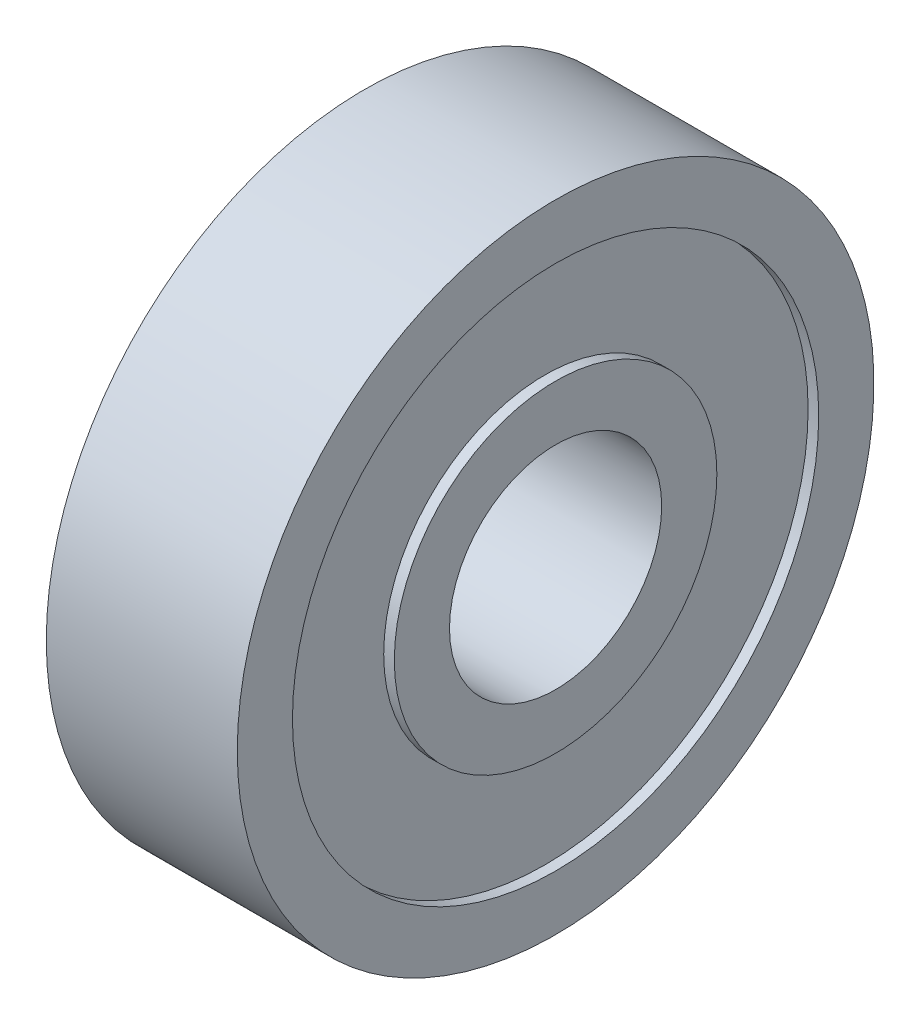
from build123d import *

# Parameters (mm, degrees)
ESQUISSE1_R = 2.9
ESQUISSE1_W = 0.5
ESQUISSE1_H = 5.6


with BuildPart() as part:
    # Esquisse1 → R_volution1 (revolve)
    with BuildSketch(Plane.XY, mode=Mode.PRIVATE) as r_volution1_sk:
        with Locations((4.5, 10)):
            Circle(ESQUISSE1_R)
        with BuildLine():
            Line((0, 15), (9, 15))
            Line((9, 15), (9, 12.4))
            Line((9, 12.4), (8.5, 12.4))
            Line((8.5, 12.4), (8.5, 12.9))
            Line((8.5, 12.9), (7.8, 12.9))
            Line((7.8, 12.9), (7.8, 12.4))
            Line((7.8, 12.4), (6.3, 12.4))
            ThreePointArc((6.3, 12.4), (4.5, 13), (2.7, 12.4))
            Line((2.7, 12.4), (1.2, 12.4))
            Line((1.2, 12.4), (1.2, 12.9))
            Line((1.2, 12.9), (0.5, 12.9))
            Line((0.5, 12.9), (0.5, 12.4))
            Line((0.5, 12.4), (0, 12.4))
            Line((0, 12.4), (0, 15))
        make_face()
        with BuildLine():
            Line((0, 7.6), (0.5, 7.6))
            Line((0.5, 7.6), (0.5, 7.1))
            Line((0.5, 7.1), (1.2, 7.1))
            Line((1.2, 7.1), (1.2, 7.6))
            Line((1.2, 7.6), (2.7, 7.6))
            ThreePointArc((2.7, 7.6), (4.5, 7), (6.3, 7.6))
            Line((6.3, 7.6), (7.8, 7.6))
            Line((7.8, 7.6), (7.8, 7.1))
            Line((7.8, 7.1), (8.5, 7.1))
            Line((8.5, 7.1), (8.5, 7.6))
            Line((8.5, 7.6), (9, 7.6))
            Line((9, 7.6), (9, 5))
            Line((9, 5), (0, 5))
            Line((0, 5), (0, 7.6))
        make_face()
        with Locations((0.85, 10)):
            Rectangle(ESQUISSE1_W, ESQUISSE1_H)
        with Locations((8.15, 10)):
            Rectangle(ESQUISSE1_W, ESQUISSE1_H)
    revolve(r_volution1_sk.sketch.rotate(Axis((0, 0, 0), (1, 0, 0)), 90), axis=Axis((0, 0, 0), (1, 0, 0)))


solid = part.part
